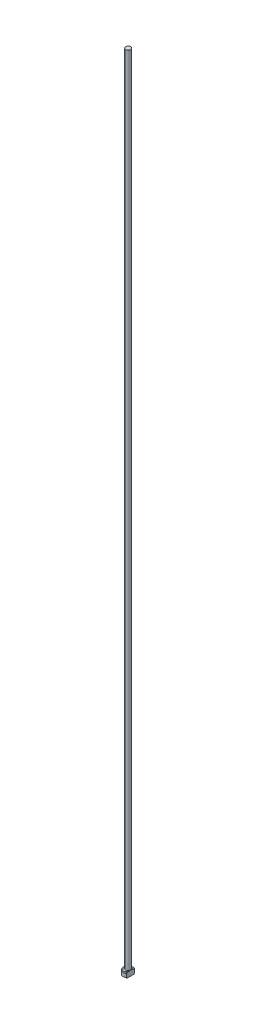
ISO-10303-21;
HEADER;
FILE_DESCRIPTION(('STEP AP214'),'2;1');
FILE_NAME('part.step','',(''),(''),'','','');
FILE_SCHEMA(('AUTOMOTIVE_DESIGN { 1 0 10303 214 1 1 1 1 }'));
ENDSEC;
DATA;
#1=APPLICATION_CONTEXT('core data for automotive mechanical design processes');
#2=APPLICATION_PROTOCOL_DEFINITION('international standard','automotive_design',2000,#1);
#3=PRODUCT_CONTEXT('',#1,'mechanical');
#4=PRODUCT('Part','Part','',(#3));
#5=PRODUCT_RELATED_PRODUCT_CATEGORY('part','',(#4));
#6=PRODUCT_DEFINITION_FORMATION('','',#4);
#7=PRODUCT_DEFINITION_CONTEXT('part definition',#1,'design');
#8=PRODUCT_DEFINITION('design','',#6,#7);
#9=PRODUCT_DEFINITION_SHAPE('','',#8);
#10=(LENGTH_UNIT() NAMED_UNIT(*) SI_UNIT(.MILLI.,.METRE.));
#11=(NAMED_UNIT(*) PLANE_ANGLE_UNIT() SI_UNIT($,.RADIAN.));
#12=(NAMED_UNIT(*) SI_UNIT($,.STERADIAN.) SOLID_ANGLE_UNIT());
#13=UNCERTAINTY_MEASURE_WITH_UNIT(LENGTH_MEASURE(1.E-05),#10,'distance_accuracy_value','');
#14=(GEOMETRIC_REPRESENTATION_CONTEXT(3) GLOBAL_UNCERTAINTY_ASSIGNED_CONTEXT((#13)) GLOBAL_UNIT_ASSIGNED_CONTEXT((#10,
#11,#12)) REPRESENTATION_CONTEXT('',''));
#15=CARTESIAN_POINT('',(0.,0.,0.));
#16=DIRECTION('',(0.,0.,1.));
#17=DIRECTION('',(1.,0.,0.));
#18=AXIS2_PLACEMENT_3D('',#15,#16,#17);
#19=CARTESIAN_POINT('',(0.,0.,0.));
#20=DIRECTION('',(0.,-1.,0.));
#21=DIRECTION('',(0.,0.,-1.));
#22=AXIS2_PLACEMENT_3D('',#19,#20,#21);
#23=PLANE('',#22);
#24=CARTESIAN_POINT('',(0.,0.,0.));
#25=DIRECTION('',(0.,-1.,0.));
#26=DIRECTION('',(0.,0.,-1.));
#27=AXIS2_PLACEMENT_3D('',#24,#25,#26);
#28=CIRCLE('',#27,1.29999999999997);
#29=CARTESIAN_POINT('',(0.799999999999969,0.,1.02469507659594));
#30=VERTEX_POINT('',#29);
#31=CARTESIAN_POINT('',(0.799999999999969,0.,-1.02469507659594));
#32=VERTEX_POINT('',#31);
#33=EDGE_CURVE('E98',#30,#32,#28,.T.);
#34=ORIENTED_EDGE('',*,*,#33,.T.);
#35=DIRECTION('',(0.,0.,1.));
#36=VECTOR('',#35,1.);
#37=CARTESIAN_POINT('',(0.799999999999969,0.,-1.26885775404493));
#38=LINE('',#37,#36);
#39=EDGE_CURVE('E83',#32,#30,#38,.T.);
#40=ORIENTED_EDGE('',*,*,#39,.T.);
#41=EDGE_LOOP('',(#34,#40));
#42=FACE_BOUND('',#41,.T.);
#43=ADVANCED_FACE('F32',(#42),#23,.T.);
#44=CARTESIAN_POINT('',(0.,259.958771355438,0.));
#45=DIRECTION('',(0.,1.,0.));
#46=DIRECTION('',(0.,0.,1.));
#47=AXIS2_PLACEMENT_3D('',#44,#45,#46);
#48=CYLINDRICAL_SURFACE('',#47,1.49999999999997);
#49=CARTESIAN_POINT('',(0.,1.29999999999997,0.));
#50=DIRECTION('',(0.,1.,0.));
#51=DIRECTION('',(0.,0.,1.));
#52=AXIS2_PLACEMENT_3D('',#49,#50,#51);
#53=CIRCLE('',#52,1.49999999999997);
#54=CARTESIAN_POINT('',(0.799999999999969,1.29999999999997,1.26885775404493));
#55=VERTEX_POINT('',#54);
#56=CARTESIAN_POINT('',(0.799999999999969,1.29999999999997,-1.26885775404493));
#57=VERTEX_POINT('',#56);
#58=EDGE_CURVE('E104',#55,#57,#53,.F.);
#59=ORIENTED_EDGE('',*,*,#58,.T.);
#60=DIRECTION('',(0.,-1.,0.));
#61=VECTOR('',#60,1.);
#62=CARTESIAN_POINT('',(0.799999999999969,250.,-1.26885775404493));
#63=LINE('',#62,#61);
#64=CARTESIAN_POINT('',(0.799999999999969,0.199999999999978,-1.26885775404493));
#65=VERTEX_POINT('',#64);
#66=EDGE_CURVE('E183',#57,#65,#63,.T.);
#67=ORIENTED_EDGE('',*,*,#66,.T.);
#68=CARTESIAN_POINT('',(0.,0.199999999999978,0.));
#69=DIRECTION('',(0.,-1.,0.));
#70=DIRECTION('',(0.,0.,-1.));
#71=AXIS2_PLACEMENT_3D('',#68,#69,#70);
#72=CIRCLE('',#71,1.49999999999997);
#73=CARTESIAN_POINT('',(0.799999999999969,0.199999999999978,1.26885775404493));
#74=VERTEX_POINT('',#73);
#75=EDGE_CURVE('E100',#65,#74,#72,.F.);
#76=ORIENTED_EDGE('',*,*,#75,.T.);
#77=DIRECTION('',(0.,-1.,0.));
#78=VECTOR('',#77,1.);
#79=CARTESIAN_POINT('',(0.799999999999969,250.,1.26885775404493));
#80=LINE('',#79,#78);
#81=EDGE_CURVE('E93',#55,#74,#80,.T.);
#82=ORIENTED_EDGE('',*,*,#81,.F.);
#83=EDGE_LOOP('',(#59,#67,#76,#82));
#84=FACE_BOUND('',#83,.T.);
#85=ADVANCED_FACE('F158',(#84),#48,.T.);
#86=CARTESIAN_POINT('',(-1.49999999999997,1.5,0.));
#87=DIRECTION('',(0.,1.,0.));
#88=DIRECTION('',(0.,0.,1.));
#89=AXIS2_PLACEMENT_3D('',#86,#87,#88);
#90=PLANE('',#89);
#91=CARTESIAN_POINT('',(0.,1.5,0.));
#92=DIRECTION('',(0.,1.,0.));
#93=DIRECTION('',(0.,0.,1.));
#94=AXIS2_PLACEMENT_3D('',#91,#92,#93);
#95=CIRCLE('',#94,1.29999999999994);
#96=CARTESIAN_POINT('',(0.799999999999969,1.5,-1.02469507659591));
#97=VERTEX_POINT('',#96);
#98=CARTESIAN_POINT('',(0.799999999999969,1.5,1.02469507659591));
#99=VERTEX_POINT('',#98);
#100=EDGE_CURVE('E178',#97,#99,#95,.T.);
#101=ORIENTED_EDGE('',*,*,#100,.T.);
#102=DIRECTION('',(0.,0.,-1.));
#103=VECTOR('',#102,1.);
#104=CARTESIAN_POINT('',(0.799999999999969,1.5,0.));
#105=LINE('',#104,#103);
#106=CARTESIAN_POINT('',(0.799999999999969,1.49999999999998,0.599999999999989));
#107=VERTEX_POINT('',#106);
#108=EDGE_CURVE('E57',#99,#107,#105,.T.);
#109=ORIENTED_EDGE('',*,*,#108,.T.);
#110=CARTESIAN_POINT('',(0.,1.5,0.));
#111=DIRECTION('',(0.,1.,0.));
#112=DIRECTION('',(0.,0.,1.));
#113=AXIS2_PLACEMENT_3D('',#110,#111,#112);
#114=CIRCLE('',#113,0.999999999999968);
#115=CARTESIAN_POINT('',(0.799999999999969,1.49999999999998,-0.600000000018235));
#116=VERTEX_POINT('',#115);
#117=EDGE_CURVE('E107',#107,#116,#114,.F.);
#118=ORIENTED_EDGE('',*,*,#117,.T.);
#119=EDGE_CURVE('E136',#116,#97,#105,.T.);
#120=ORIENTED_EDGE('',*,*,#119,.T.);
#121=EDGE_LOOP('',(#101,#109,#118,#120));
#122=FACE_BOUND('',#121,.T.);
#123=ADVANCED_FACE('F147',(#122),#90,.T.);
#124=CARTESIAN_POINT('',(0.,1.5,0.));
#125=DIRECTION('',(0.,-1.,0.));
#126=DIRECTION('',(0.,0.,-1.));
#127=AXIS2_PLACEMENT_3D('',#124,#125,#126);
#128=CONICAL_SURFACE('',#127,1.29999999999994,0.785398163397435);
#129=ORIENTED_EDGE('',*,*,#58,.F.);
#130=CARTESIAN_POINT('',(0.799999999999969,-0.108590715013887,2.79640840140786));
#131=CARTESIAN_POINT('',(0.799999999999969,-0.000882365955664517,2.68432462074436));
#132=CARTESIAN_POINT('',(0.799999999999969,0.106624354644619,2.57204275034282));
#133=CARTESIAN_POINT('',(0.799999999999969,0.320918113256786,2.34672914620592));
#134=CARTESIAN_POINT('',(0.799999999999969,0.427704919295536,2.23369719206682));
#135=CARTESIAN_POINT('',(0.799999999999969,0.639300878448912,2.00753337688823));
#136=CARTESIAN_POINT('',(0.799999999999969,0.744119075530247,1.894410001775));
#137=CARTESIAN_POINT('',(0.799999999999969,0.951972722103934,1.66655886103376));
#138=CARTESIAN_POINT('',(0.799999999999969,1.05500843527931,1.55183133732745));
#139=CARTESIAN_POINT('',(0.799999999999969,1.2316116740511,1.34966755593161));
#140=CARTESIAN_POINT('',(0.799999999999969,1.30589617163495,1.26286366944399));
#141=CARTESIAN_POINT('',(0.799999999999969,1.41524859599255,1.13055151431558));
#142=CARTESIAN_POINT('',(0.799999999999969,1.45144464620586,1.08597829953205));
#143=CARTESIAN_POINT('',(0.799999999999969,1.52278909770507,0.99600355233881));
#144=CARTESIAN_POINT('',(0.799999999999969,1.55793758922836,0.950602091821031));
#145=CARTESIAN_POINT('',(0.799999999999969,1.62707562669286,0.858309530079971));
#146=CARTESIAN_POINT('',(0.799999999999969,1.66105269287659,0.81140901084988));
#147=CARTESIAN_POINT('',(0.799999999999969,1.72689099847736,0.716070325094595));
#148=CARTESIAN_POINT('',(0.799999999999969,1.75875040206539,0.667630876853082));
#149=CARTESIAN_POINT('',(0.799999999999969,1.81908230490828,0.568961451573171));
#150=CARTESIAN_POINT('',(0.799999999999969,1.84757011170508,0.518741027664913));
#151=CARTESIAN_POINT('',(0.799999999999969,1.89949059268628,0.415809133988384));
#152=CARTESIAN_POINT('',(0.799999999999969,1.92293317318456,0.363102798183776));
#153=CARTESIAN_POINT('',(0.799999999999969,1.96197481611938,0.254586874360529));
#154=CARTESIAN_POINT('',(0.799999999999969,1.97756580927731,0.19877415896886));
#155=CARTESIAN_POINT('',(0.799999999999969,1.99243400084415,0.113761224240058));
#156=CARTESIAN_POINT('',(0.799999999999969,1.99597240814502,0.0852975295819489));
#157=CARTESIAN_POINT('',(0.799999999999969,2.00001065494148,0.0281499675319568));
#158=CARTESIAN_POINT('',(0.799999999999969,2.00051084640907,-0.000533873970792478));
#159=CARTESIAN_POINT('',(0.799999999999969,1.99842510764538,-0.0578277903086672));
#160=CARTESIAN_POINT('',(0.799999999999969,1.99583465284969,-0.0864376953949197));
#161=CARTESIAN_POINT('',(0.799999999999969,1.98776318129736,-0.143248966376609));
#162=CARTESIAN_POINT('',(0.799999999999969,1.98228105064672,-0.171450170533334));
#163=CARTESIAN_POINT('',(0.799999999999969,1.96874374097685,-0.227447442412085));
#164=CARTESIAN_POINT('',(0.799999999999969,1.96066903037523,-0.255238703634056));
#165=CARTESIAN_POINT('',(0.799999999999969,1.94239006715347,-0.310100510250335));
#166=CARTESIAN_POINT('',(0.799999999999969,1.93218575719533,-0.337171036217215));
#167=CARTESIAN_POINT('',(0.799999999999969,1.89406620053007,-0.429279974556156));
#168=CARTESIAN_POINT('',(0.799999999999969,1.86189848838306,-0.492545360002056));
#169=CARTESIAN_POINT('',(0.799999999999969,1.79172992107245,-0.615769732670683));
#170=CARTESIAN_POINT('',(0.799999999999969,1.75371426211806,-0.675719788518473));
#171=CARTESIAN_POINT('',(0.799999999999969,1.6737943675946,-0.793878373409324));
#172=CARTESIAN_POINT('',(0.799999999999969,1.63185308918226,-0.852061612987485));
#173=CARTESIAN_POINT('',(0.799999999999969,1.54580257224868,-0.966661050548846));
#174=CARTESIAN_POINT('',(0.799999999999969,1.50169617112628,-1.02307941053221));
#175=CARTESIAN_POINT('',(0.799999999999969,1.39425482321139,-1.15684265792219));
#176=CARTESIAN_POINT('',(0.799999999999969,1.33022313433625,-1.23362537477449));
#177=CARTESIAN_POINT('',(0.799999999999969,1.20042261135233,-1.38571338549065));
#178=CARTESIAN_POINT('',(0.799999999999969,1.13465351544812,-1.46101845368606));
#179=CARTESIAN_POINT('',(0.799999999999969,1.00190865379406,-1.61069142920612));
#180=CARTESIAN_POINT('',(0.799999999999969,0.934931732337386,-1.68505830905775));
#181=CARTESIAN_POINT('',(0.799999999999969,0.8001914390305,-1.83307655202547));
#182=CARTESIAN_POINT('',(0.799999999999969,0.732428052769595,-1.90672790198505));
#183=CARTESIAN_POINT('',(0.799999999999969,0.600628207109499,-2.04887725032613));
#184=CARTESIAN_POINT('',(0.799999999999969,0.536626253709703,-2.11740728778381));
#185=CARTESIAN_POINT('',(0.799999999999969,0.408245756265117,-2.25411608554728));
#186=CARTESIAN_POINT('',(0.799999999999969,0.343867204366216,-2.32229483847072));
#187=CARTESIAN_POINT('',(0.799999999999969,0.214937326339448,-2.45825447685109));
#188=CARTESIAN_POINT('',(0.799999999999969,0.150386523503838,-2.52603585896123));
#189=CARTESIAN_POINT('',(0.799999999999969,0.0210558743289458,-2.66137559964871));
#190=CARTESIAN_POINT('',(0.799999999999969,-0.0437239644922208,-2.72893396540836));
#191=CARTESIAN_POINT('',(0.799999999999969,-0.108590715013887,-2.79640840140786));
#192=B_SPLINE_CURVE_WITH_KNOTS('',3,(#130,#131,#132,#133,#134,#135,#136,#137,#138,#139,#140,
#141,#142,#143,#144,#145,#146,#147,#148,#149,#150,#151,#152,#153,#154,#155,#156,#157,#158,#159,
#160,#161,#162,#163,#164,#165,#166,#167,#168,#169,#170,#171,#172,#173,#174,#175,#176,#177,#178,
#179,#180,#181,#182,#183,#184,#185,#186,#187,#188,#189,#190,#191),.UNSPECIFIED.,.F.,.F.,(4,2,2,
2,2,2,2,2,2,2,2,2,2,2,2,2,2,2,2,2,2,2,2,2,2,2,2,2,2,2,4),(0.,0.466346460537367,
0.932836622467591,1.39548573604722,1.85806581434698,2.20076900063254,2.37301446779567,
2.54524505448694,2.71894834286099,2.89280030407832,3.06582993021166,3.23851664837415,
3.41138048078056,3.49728508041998,3.58317972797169,3.66920027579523,3.75525398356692,
3.84197183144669,3.92869201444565,4.14096510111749,4.35378466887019,4.56886671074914,
4.78367404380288,5.08356111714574,5.38349363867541,5.68373022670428,5.9839723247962,
6.26527738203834,6.54658832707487,6.82739033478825,7.10818320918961),.UNSPECIFIED.);
#193=EDGE_CURVE('E135',#55,#99,#192,.T.);
#194=ORIENTED_EDGE('',*,*,#193,.T.);
#195=ORIENTED_EDGE('',*,*,#100,.F.);
#196=EDGE_CURVE('E127',#97,#57,#192,.T.);
#197=ORIENTED_EDGE('',*,*,#196,.T.);
#198=EDGE_LOOP('',(#129,#194,#195,#197));
#199=FACE_BOUND('',#198,.T.);
#200=ADVANCED_FACE('F143',(#199),#128,.T.);
#201=CARTESIAN_POINT('',(0.,0.199999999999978,0.));
#202=DIRECTION('',(0.,1.,0.));
#203=DIRECTION('',(0.,0.,1.));
#204=AXIS2_PLACEMENT_3D('',#201,#202,#203);
#205=CONICAL_SURFACE('',#204,1.49999999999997,0.785398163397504);
#206=ORIENTED_EDGE('',*,*,#75,.F.);
#207=CARTESIAN_POINT('',(0.799999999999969,1.60859071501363,-2.79640840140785));
#208=CARTESIAN_POINT('',(0.799999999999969,1.50088236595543,-2.68432462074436));
#209=CARTESIAN_POINT('',(0.799999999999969,1.39337564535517,-2.57204275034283));
#210=CARTESIAN_POINT('',(0.799999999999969,1.17908188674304,-2.34672914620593));
#211=CARTESIAN_POINT('',(0.799999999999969,1.07229508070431,-2.23369719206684));
#212=CARTESIAN_POINT('',(0.799999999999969,0.860699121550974,-2.00753337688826));
#213=CARTESIAN_POINT('',(0.799999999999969,0.75588092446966,-1.89441000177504));
#214=CARTESIAN_POINT('',(0.799999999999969,0.548027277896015,-1.66655886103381));
#215=CARTESIAN_POINT('',(0.799999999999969,0.444991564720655,-1.55183133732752));
#216=CARTESIAN_POINT('',(0.799999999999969,0.268388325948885,-1.34966755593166));
#217=CARTESIAN_POINT('',(0.799999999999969,0.194103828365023,-1.26286366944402));
#218=CARTESIAN_POINT('',(0.799999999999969,0.0847514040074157,-1.13055151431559));
#219=CARTESIAN_POINT('',(0.799999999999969,0.0485553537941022,-1.08597829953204));
#220=CARTESIAN_POINT('',(0.799999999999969,-0.02278909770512,-0.996003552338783));
#221=CARTESIAN_POINT('',(0.799999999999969,-0.0579375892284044,-0.950602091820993));
#222=CARTESIAN_POINT('',(0.799999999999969,-0.127075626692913,-0.85830953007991));
#223=CARTESIAN_POINT('',(0.799999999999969,-0.161052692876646,-0.811409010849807));
#224=CARTESIAN_POINT('',(0.799999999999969,-0.226890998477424,-0.716070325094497));
#225=CARTESIAN_POINT('',(0.799999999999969,-0.258750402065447,-0.667630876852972));
#226=CARTESIAN_POINT('',(0.799999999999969,-0.319082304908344,-0.568961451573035));
#227=CARTESIAN_POINT('',(0.799999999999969,-0.347570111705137,-0.518741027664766));
#228=CARTESIAN_POINT('',(0.799999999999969,-0.399490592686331,-0.41580913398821));
#229=CARTESIAN_POINT('',(0.799999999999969,-0.422933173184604,-0.363102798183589));
#230=CARTESIAN_POINT('',(0.799999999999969,-0.461974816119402,-0.254586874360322));
#231=CARTESIAN_POINT('',(0.799999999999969,-0.477565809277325,-0.198774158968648));
#232=CARTESIAN_POINT('',(0.799999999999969,-0.492434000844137,-0.113761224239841));
#233=CARTESIAN_POINT('',(0.799999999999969,-0.495972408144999,-0.0852975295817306));
#234=CARTESIAN_POINT('',(0.799999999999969,-0.500010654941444,-0.0281499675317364));
#235=CARTESIAN_POINT('',(0.799999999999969,-0.500510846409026,0.000533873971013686));
#236=CARTESIAN_POINT('',(0.799999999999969,-0.49842510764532,0.0578277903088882));
#237=CARTESIAN_POINT('',(0.799999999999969,-0.495834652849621,0.0864376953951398));
#238=CARTESIAN_POINT('',(0.799999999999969,-0.487763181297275,0.143248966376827));
#239=CARTESIAN_POINT('',(0.799999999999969,-0.482281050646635,0.17145017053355));
#240=CARTESIAN_POINT('',(0.799999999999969,-0.468743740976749,0.227447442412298));
#241=CARTESIAN_POINT('',(0.799999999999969,-0.460669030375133,0.255238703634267));
#242=CARTESIAN_POINT('',(0.799999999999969,-0.442390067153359,0.310100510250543));
#243=CARTESIAN_POINT('',(0.799999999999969,-0.432185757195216,0.33717103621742));
#244=CARTESIAN_POINT('',(0.799999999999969,-0.394066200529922,0.429279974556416));
#245=CARTESIAN_POINT('',(0.799999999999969,-0.361898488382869,0.492545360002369));
#246=CARTESIAN_POINT('',(0.799999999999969,-0.291729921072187,0.615769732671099));
#247=CARTESIAN_POINT('',(0.799999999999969,-0.253714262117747,0.675719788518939));
#248=CARTESIAN_POINT('',(0.799999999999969,-0.173794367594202,0.793878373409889));
#249=CARTESIAN_POINT('',(0.799999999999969,-0.131853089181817,0.852061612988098));
#250=CARTESIAN_POINT('',(0.799999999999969,-0.0458025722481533,0.966661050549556));
#251=CARTESIAN_POINT('',(0.799999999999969,-0.00169617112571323,1.02307941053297));
#252=CARTESIAN_POINT('',(0.799999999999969,0.10574517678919,1.15684265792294));
#253=CARTESIAN_POINT('',(0.799999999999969,0.169776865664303,1.2336253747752));
#254=CARTESIAN_POINT('',(0.799999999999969,0.299577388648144,1.38571338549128));
#255=CARTESIAN_POINT('',(0.799999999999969,0.365346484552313,1.46101845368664));
#256=CARTESIAN_POINT('',(0.799999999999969,0.498091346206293,1.61069142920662));
#257=CARTESIAN_POINT('',(0.799999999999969,0.565068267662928,1.68505830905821));
#258=CARTESIAN_POINT('',(0.799999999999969,0.699808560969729,1.83307655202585));
#259=CARTESIAN_POINT('',(0.799999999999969,0.767571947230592,1.9067279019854));
#260=CARTESIAN_POINT('',(0.799999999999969,0.899371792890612,2.04887725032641));
#261=CARTESIAN_POINT('',(0.799999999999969,0.963373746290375,2.11740728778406));
#262=CARTESIAN_POINT('',(0.799999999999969,1.09175424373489,2.25411608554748));
#263=CARTESIAN_POINT('',(0.799999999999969,1.15613279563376,2.32229483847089));
#264=CARTESIAN_POINT('',(0.799999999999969,1.28506267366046,2.45825447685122));
#265=CARTESIAN_POINT('',(0.799999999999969,1.34961347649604,2.52603585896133));
#266=CARTESIAN_POINT('',(0.799999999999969,1.47894412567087,2.66137559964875));
#267=CARTESIAN_POINT('',(0.799999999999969,1.543723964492,2.72893396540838));
#268=CARTESIAN_POINT('',(0.799999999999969,1.60859071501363,2.79640840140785));
#269=B_SPLINE_CURVE_WITH_KNOTS('',3,(#207,#208,#209,#210,#211,#212,#213,#214,#215,#216,#217,
#218,#219,#220,#221,#222,#223,#224,#225,#226,#227,#228,#229,#230,#231,#232,#233,#234,#235,#236,
#237,#238,#239,#240,#241,#242,#243,#244,#245,#246,#247,#248,#249,#250,#251,#252,#253,#254,#255,
#256,#257,#258,#259,#260,#261,#262,#263,#264,#265,#266,#267,#268),.UNSPECIFIED.,.F.,.F.,(4,2,2,
2,2,2,2,2,2,2,2,2,2,2,2,2,2,2,2,2,2,2,2,2,2,2,2,2,2,2,4),(0.,0.466346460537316,0.93283662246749,
1.39548573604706,1.85806581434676,2.20076900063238,2.37301446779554,2.54524505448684,
2.71894834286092,2.89280030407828,3.06582993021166,3.23851664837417,3.41138048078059,
3.49728508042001,3.58317972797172,3.66920027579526,3.75525398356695,3.84197183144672,
3.92869201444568,4.14096510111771,4.3537846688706,4.56886671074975,4.78367404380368,
5.08356111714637,5.38349363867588,5.68373022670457,5.98397232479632,6.26527738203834,
6.54658832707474,6.82739033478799,7.10818320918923),.UNSPECIFIED.);
#270=EDGE_CURVE('E86',#65,#32,#269,.T.);
#271=ORIENTED_EDGE('',*,*,#270,.T.);
#272=ORIENTED_EDGE('',*,*,#33,.F.);
#273=EDGE_CURVE('E89',#30,#74,#269,.T.);
#274=ORIENTED_EDGE('',*,*,#273,.T.);
#275=EDGE_LOOP('',(#206,#271,#272,#274));
#276=FACE_BOUND('',#275,.T.);
#277=ADVANCED_FACE('F97',(#276),#205,.T.);
#278=CARTESIAN_POINT('',(0.,1.69999999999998,0.));
#279=DIRECTION('',(0.,1.,0.));
#280=DIRECTION('',(0.,0.,1.));
#281=AXIS2_PLACEMENT_3D('',#278,#279,#280);
#282=TOROIDAL_SURFACE('',#281,0.999999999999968,0.2);
#283=CARTESIAN_POINT('',(0.799999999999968,1.69999999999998,0.));
#284=CARTESIAN_POINT('',(0.799999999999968,1.70000052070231,-1.07740569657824E-10));
#285=CARTESIAN_POINT('',(0.799999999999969,1.70000104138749,-8.25850860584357E-08));
#286=CARTESIAN_POINT('',(0.799999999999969,1.7000020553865,-3.57496578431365E-07));
#287=CARTESIAN_POINT('',(0.799999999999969,1.7000025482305,-5.51414205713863E-07));
#288=CARTESIAN_POINT('',(0.799999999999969,1.70000352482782,-1.02256682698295E-06));
#289=CARTESIAN_POINT('',(0.799999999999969,1.70000400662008,-1.30376835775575E-06));
#290=CARTESIAN_POINT('',(0.799999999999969,1.7000049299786,-1.92036681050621E-06));
#291=CARTESIAN_POINT('',(0.799999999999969,1.70000537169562,-2.25554622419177E-06));
#292=CARTESIAN_POINT('',(0.799999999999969,1.70000679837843,-3.42582461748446E-06));
#293=CARTESIAN_POINT('',(0.799999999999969,1.7000077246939,-4.33303061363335E-06));
#294=CARTESIAN_POINT('',(0.799999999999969,1.70000942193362,-6.24182407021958E-06));
#295=CARTESIAN_POINT('',(0.799999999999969,1.70001019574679,-7.24099037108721E-06));
#296=CARTESIAN_POINT('',(0.799999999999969,1.70001296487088,-1.10006264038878E-05));
#297=CARTESIAN_POINT('',(0.799999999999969,1.70001480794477,-1.38764659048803E-05));
#298=CARTESIAN_POINT('',(0.799999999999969,1.70001794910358,-1.96579256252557E-05));
#299=CARTESIAN_POINT('',(0.799999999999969,1.70001927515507,-2.25490182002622E-05));
#300=CARTESIAN_POINT('',(0.799999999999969,1.70002465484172,-3.44465536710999E-05));
#301=CARTESIAN_POINT('',(0.799999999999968,1.70002857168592,-4.35098174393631E-05));
#302=CARTESIAN_POINT('',(0.799999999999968,1.70003510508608,-6.07223717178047E-05));
#303=CARTESIAN_POINT('',(0.799999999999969,1.70003782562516,-6.88309361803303E-05));
#304=CARTESIAN_POINT('',(0.799999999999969,1.70005864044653,-0.000125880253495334));
#305=CARTESIAN_POINT('',(0.799999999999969,1.70008424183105,-0.000171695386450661));
#306=CARTESIAN_POINT('',(0.799999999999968,1.70017855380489,-0.00034720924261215));
#307=CARTESIAN_POINT('',(0.799999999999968,1.70024169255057,-0.000479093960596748));
#308=CARTESIAN_POINT('',(0.799999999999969,1.70048616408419,-0.000981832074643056));
#309=CARTESIAN_POINT('',(0.799999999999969,1.70067331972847,-0.00135043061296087));
#310=CARTESIAN_POINT('',(0.799999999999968,1.70142117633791,-0.00283094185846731));
#311=CARTESIAN_POINT('',(0.799999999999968,1.70197535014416,-0.00394535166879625));
#312=CARTESIAN_POINT('',(0.799999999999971,1.71061058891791,-0.0213011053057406));
#313=CARTESIAN_POINT('',(0.799999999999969,1.71874400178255,-0.0375230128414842));
#314=CARTESIAN_POINT('',(0.799999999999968,1.73460832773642,-0.0694811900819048));
#315=CARTESIAN_POINT('',(0.799999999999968,1.74234357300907,-0.0852154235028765));
#316=CARTESIAN_POINT('',(0.799999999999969,1.75846316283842,-0.118454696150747));
#317=CARTESIAN_POINT('',(0.799999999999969,1.7668284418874,-0.135969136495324));
#318=CARTESIAN_POINT('',(0.799999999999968,1.78329738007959,-0.171319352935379));
#319=CARTESIAN_POINT('',(0.799999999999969,1.79139788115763,-0.189156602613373));
#320=CARTESIAN_POINT('',(0.799999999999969,1.81123303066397,-0.234404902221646));
#321=CARTESIAN_POINT('',(0.799999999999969,1.82265785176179,-0.261953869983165));
#322=CARTESIAN_POINT('',(0.799999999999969,1.84367616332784,-0.31710366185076));
#323=CARTESIAN_POINT('',(0.799999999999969,1.85330270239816,-0.344691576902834));
#324=CARTESIAN_POINT('',(0.799999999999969,1.86619221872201,-0.38675392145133));
#325=CARTESIAN_POINT('',(0.799999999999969,1.87025173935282,-0.400983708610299));
#326=CARTESIAN_POINT('',(0.799999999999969,1.87774404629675,-0.429670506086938));
#327=CARTESIAN_POINT('',(0.799999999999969,1.8811740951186,-0.44412822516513));
#328=CARTESIAN_POINT('',(0.799999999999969,1.89063941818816,-0.489163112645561));
#329=CARTESIAN_POINT('',(0.799999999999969,1.89540671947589,-0.520030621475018));
#330=CARTESIAN_POINT('',(0.799999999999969,1.90049267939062,-0.58212622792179));
#331=CARTESIAN_POINT('',(0.799999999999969,1.90081735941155,-0.613353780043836));
#332=CARTESIAN_POINT('',(0.799999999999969,1.89549709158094,-0.674915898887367));
#333=CARTESIAN_POINT('',(0.799999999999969,1.88995916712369,-0.705256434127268));
#334=CARTESIAN_POINT('',(0.799999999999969,1.8763682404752,-0.747474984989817));
#335=CARTESIAN_POINT('',(0.799999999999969,1.8713676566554,-0.760339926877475));
#336=CARTESIAN_POINT('',(0.799999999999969,1.85959942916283,-0.785299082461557));
#337=CARTESIAN_POINT('',(0.799999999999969,1.85282697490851,-0.79739108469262));
#338=CARTESIAN_POINT('',(0.799999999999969,1.83727733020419,-0.820446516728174));
#339=CARTESIAN_POINT('',(0.799999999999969,1.82847700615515,-0.831394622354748));
#340=CARTESIAN_POINT('',(0.799999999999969,1.80887943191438,-0.851318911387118));
#341=CARTESIAN_POINT('',(0.799999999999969,1.79808937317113,-0.860301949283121));
#342=CARTESIAN_POINT('',(0.799999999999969,1.77879935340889,-0.872872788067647));
#343=CARTESIAN_POINT('',(0.799999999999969,1.77081074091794,-0.877249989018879));
#344=CARTESIAN_POINT('',(0.799999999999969,1.75421627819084,-0.884624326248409));
#345=CARTESIAN_POINT('',(0.799999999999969,1.74561080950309,-0.887622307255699));
#346=CARTESIAN_POINT('',(0.799999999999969,1.72796171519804,-0.892065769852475));
#347=CARTESIAN_POINT('',(0.799999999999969,1.7189162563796,-0.893504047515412));
#348=CARTESIAN_POINT('',(0.799999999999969,1.70071433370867,-0.894703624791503));
#349=CARTESIAN_POINT('',(0.799999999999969,1.69155789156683,-0.894465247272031));
#350=CARTESIAN_POINT('',(0.799999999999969,1.67411305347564,-0.892409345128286));
#351=CARTESIAN_POINT('',(0.799999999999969,1.66581040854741,-0.890709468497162));
#352=CARTESIAN_POINT('',(0.799999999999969,1.64959326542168,-0.885987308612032));
#353=CARTESIAN_POINT('',(0.799999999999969,1.64167879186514,-0.882964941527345));
#354=CARTESIAN_POINT('',(0.799999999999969,1.62612521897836,-0.875619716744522));
#355=CARTESIAN_POINT('',(0.799999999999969,1.6185069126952,-0.871253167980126));
#356=CARTESIAN_POINT('',(0.799999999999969,1.60398538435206,-0.861466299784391));
#357=CARTESIAN_POINT('',(0.799999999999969,1.59708247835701,-0.856045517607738));
#358=CARTESIAN_POINT('',(0.799999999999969,1.58115991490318,-0.841751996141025));
#359=CARTESIAN_POINT('',(0.799999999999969,1.57255696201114,-0.832413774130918));
#360=CARTESIAN_POINT('',(0.799999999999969,1.5569709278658,-0.812463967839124));
#361=CARTESIAN_POINT('',(0.799999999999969,1.54999208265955,-0.80184916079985));
#362=CARTESIAN_POINT('',(0.799999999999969,1.53507995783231,-0.775315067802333));
#363=CARTESIAN_POINT('',(0.799999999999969,1.52789105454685,-0.758978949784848));
#364=CARTESIAN_POINT('',(0.799999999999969,1.51619194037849,-0.72544267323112));
#365=CARTESIAN_POINT('',(0.799999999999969,1.51167841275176,-0.708243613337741));
#366=CARTESIAN_POINT('',(0.799999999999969,1.50308125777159,-0.664008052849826));
#367=CARTESIAN_POINT('',(0.799999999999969,1.50054575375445,-0.636674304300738));
#368=CARTESIAN_POINT('',(0.799999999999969,1.49960545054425,-0.581571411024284));
#369=CARTESIAN_POINT('',(0.799999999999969,1.50126887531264,-0.553802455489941));
#370=CARTESIAN_POINT('',(0.799999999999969,1.51076969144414,-0.474087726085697));
#371=CARTESIAN_POINT('',(0.799999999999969,1.52278886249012,-0.422656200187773));
#372=CARTESIAN_POINT('',(0.799999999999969,1.54542054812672,-0.348884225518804));
#373=CARTESIAN_POINT('',(0.799999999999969,1.553391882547,-0.325596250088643));
#374=CARTESIAN_POINT('',(0.799999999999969,1.57044260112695,-0.279605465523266));
#375=CARTESIAN_POINT('',(0.799999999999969,1.5795136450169,-0.256899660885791));
#376=CARTESIAN_POINT('',(0.799999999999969,1.59612615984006,-0.217481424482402));
#377=CARTESIAN_POINT('',(0.799999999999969,1.60348346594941,-0.200689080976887));
#378=CARTESIAN_POINT('',(0.799999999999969,1.61873273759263,-0.16689025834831));
#379=CARTESIAN_POINT('',(0.799999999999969,1.62663303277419,-0.1498875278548));
#380=CARTESIAN_POINT('',(0.799999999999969,1.64000428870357,-0.12169659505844));
#381=CARTESIAN_POINT('',(0.799999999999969,1.64540046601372,-0.110472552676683));
#382=CARTESIAN_POINT('',(0.799999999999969,1.65623294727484,-0.088168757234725));
#383=CARTESIAN_POINT('',(0.799999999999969,1.66166844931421,-0.0770886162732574));
#384=CARTESIAN_POINT('',(0.799999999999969,1.67206713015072,-0.0560154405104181));
#385=CARTESIAN_POINT('',(0.799999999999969,1.67702562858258,-0.0460200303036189));
#386=CARTESIAN_POINT('',(0.799999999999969,1.68715625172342,-0.0257066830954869));
#387=CARTESIAN_POINT('',(0.799999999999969,1.69232987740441,-0.0153894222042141));
#388=CARTESIAN_POINT('',(0.799999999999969,1.69802413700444,-0.00394656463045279));
#389=CARTESIAN_POINT('',(0.799999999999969,1.69857766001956,-0.00283331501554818));
#390=CARTESIAN_POINT('',(0.799999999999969,1.69932534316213,-0.00135310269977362));
#391=CARTESIAN_POINT('',(0.799999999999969,1.69951294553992,-0.000983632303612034));
#392=CARTESIAN_POINT('',(0.799999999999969,1.69975796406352,-0.000479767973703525));
#393=CARTESIAN_POINT('',(0.799999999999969,1.69982122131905,-0.000347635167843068));
#394=CARTESIAN_POINT('',(0.799999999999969,1.69991569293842,-0.000171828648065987));
#395=CARTESIAN_POINT('',(0.799999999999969,1.69994132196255,-0.000125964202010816));
#396=CARTESIAN_POINT('',(0.799999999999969,1.69996215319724,-6.88565605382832E-05));
#397=CARTESIAN_POINT('',(0.799999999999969,1.69996487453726,-6.07436450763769E-05));
#398=CARTESIAN_POINT('',(0.799999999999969,1.69997141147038,-4.35218238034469E-05));
#399=CARTESIAN_POINT('',(0.799999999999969,1.69997533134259,-3.44537566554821E-05));
#400=CARTESIAN_POINT('',(0.799999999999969,1.69998071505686,-2.25508109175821E-05));
#401=CARTESIAN_POINT('',(0.799999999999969,1.69998204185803,-1.96589688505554E-05));
#402=CARTESIAN_POINT('',(0.799999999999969,1.69998518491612,-1.38761465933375E-05));
#403=CARTESIAN_POINT('',(0.799999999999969,1.69998702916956,-1.09997147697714E-05));
#404=CARTESIAN_POINT('',(0.799999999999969,1.6999897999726,-7.23954686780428E-06));
#405=CARTESIAN_POINT('',(0.799999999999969,1.6999905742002,-6.24031831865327E-06));
#406=CARTESIAN_POINT('',(0.799999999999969,1.69999227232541,-4.33148565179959E-06));
#407=CARTESIAN_POINT('',(0.799999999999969,1.69999319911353,-3.4243052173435E-06));
#408=CARTESIAN_POINT('',(0.799999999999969,1.69999462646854,-2.25416419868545E-06));
#409=CARTESIAN_POINT('',(0.799999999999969,1.69999506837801,-1.9190446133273E-06));
#410=CARTESIAN_POINT('',(0.799999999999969,1.69999599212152,-1.30259970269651E-06));
#411=CARTESIAN_POINT('',(0.799999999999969,1.69999647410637,-1.02149208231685E-06));
#412=CARTESIAN_POINT('',(0.799999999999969,1.69999745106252,-5.50567949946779E-07));
#413=CARTESIAN_POINT('',(0.799999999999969,1.69999794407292,-3.56781844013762E-07));
#414=CARTESIAN_POINT('',(0.799999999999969,1.69999895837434,-8.21863285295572E-08));
#415=CARTESIAN_POINT('',(0.799999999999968,1.69999947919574,1.07761657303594E-10));
#416=CARTESIAN_POINT('',(0.799999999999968,1.69999999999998,0.));
#417=B_SPLINE_CURVE_WITH_KNOTS('',3,(#283,#284,#285,#286,#287,#288,#289,#290,#291,#292,#293,
#294,#295,#296,#297,#298,#299,#300,#301,#302,#303,#304,#305,#306,#307,#308,#309,#310,#311,#312,
#313,#314,#315,#316,#317,#318,#319,#320,#321,#322,#323,#324,#325,#326,#327,#328,#329,#330,#331,
#332,#333,#334,#335,#336,#337,#338,#339,#340,#341,#342,#343,#344,#345,#346,#347,#348,#349,#350,
#351,#352,#353,#354,#355,#356,#357,#358,#359,#360,#361,#362,#363,#364,#365,#366,#367,#368,#369,
#370,#371,#372,#373,#374,#375,#376,#377,#378,#379,#380,#381,#382,#383,#384,#385,#386,#387,#388,
#389,#390,#391,#392,#393,#394,#395,#396,#397,#398,#399,#400,#401,#402,#403,#404,#405,#406,#407,
#408,#409,#410,#411,#412,#413,#414,#415,#416),.UNSPECIFIED.,.T.,.F.,(4,2,2,2,2,2,2,2,2,2,2,2,2,
2,2,2,2,2,2,2,2,2,2,2,2,2,2,2,2,2,2,2,2,2,2,2,2,2,2,2,2,2,2,2,2,2,2,2,2,2,2,2,2,2,2,2,2,2,2,2,2,
2,2,2,2,2,4),(0.,1.56041509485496E-06,3.14209997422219E-06,4.81003054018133E-06,
6.4714008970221E-06,1.03419149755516E-05,1.41300090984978E-05,2.43375473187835E-05,
3.38705168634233E-05,6.34790223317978E-05,8.91110433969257E-05,0.0002457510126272,
0.000685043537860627,0.00192443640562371,0.00565901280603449,0.0600913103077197,
0.112691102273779,0.170916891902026,0.229684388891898,0.319123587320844,0.406709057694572,
0.451087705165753,0.495654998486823,0.589095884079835,0.682410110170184,0.774049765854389,
0.815352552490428,0.856768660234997,0.898682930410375,0.940448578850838,0.967667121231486,
0.994868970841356,1.02219593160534,1.04951763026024,1.07482622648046,1.10013642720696,
1.12637630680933,1.15262773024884,1.19050680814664,1.22848360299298,1.28172910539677,
1.33490845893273,1.41680298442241,1.50003666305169,1.65746622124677,1.73131208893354,
1.80462934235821,1.85962660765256,1.91586794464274,1.95322923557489,1.990253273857,
2.02372755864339,2.05834809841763,2.06207870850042,2.06332103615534,2.06376115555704,
2.06391796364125,2.06394360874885,2.06397323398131,2.06398276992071,2.06399298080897,
2.06399676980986,2.06400064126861,2.06400230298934,2.06400397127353,2.0640055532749,
2.06400711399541),.UNSPECIFIED.);
#418=CARTESIAN_POINT('',(0.799999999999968,1.69999999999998,0.));
#419=VERTEX_POINT('',#418);
#420=EDGE_CURVE('E11',#116,#419,#417,.T.);
#421=ORIENTED_EDGE('',*,*,#420,.F.);
#422=ORIENTED_EDGE('',*,*,#117,.F.);
#423=CARTESIAN_POINT('',(0.799999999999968,1.69999999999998,0.));
#424=CARTESIAN_POINT('',(0.799999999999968,1.69999947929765,1.07740575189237E-10));
#425=CARTESIAN_POINT('',(0.799999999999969,1.69999895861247,8.25850860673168E-08));
#426=CARTESIAN_POINT('',(0.799999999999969,1.69999794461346,3.5749657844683E-07));
#427=CARTESIAN_POINT('',(0.799999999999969,1.69999745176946,5.51414205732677E-07));
#428=CARTESIAN_POINT('',(0.799999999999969,1.69999647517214,1.02256682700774E-06));
#429=CARTESIAN_POINT('',(0.799999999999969,1.69999599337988,1.30376835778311E-06));
#430=CARTESIAN_POINT('',(0.799999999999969,1.69999507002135,1.9203668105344E-06));
#431=CARTESIAN_POINT('',(0.799999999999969,1.69999462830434,2.25554622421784E-06));
#432=CARTESIAN_POINT('',(0.799999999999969,1.69999320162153,3.42582461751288E-06));
#433=CARTESIAN_POINT('',(0.799999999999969,1.69999227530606,4.33303061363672E-06));
#434=CARTESIAN_POINT('',(0.799999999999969,1.69999057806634,6.2418240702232E-06));
#435=CARTESIAN_POINT('',(0.799999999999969,1.69998980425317,7.24099037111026E-06));
#436=CARTESIAN_POINT('',(0.799999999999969,1.69998703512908,1.10006264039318E-05));
#437=CARTESIAN_POINT('',(0.799999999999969,1.69998519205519,1.38764659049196E-05));
#438=CARTESIAN_POINT('',(0.799999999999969,1.69998205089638,1.96579256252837E-05));
#439=CARTESIAN_POINT('',(0.799999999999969,1.69998072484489,2.25490182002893E-05));
#440=CARTESIAN_POINT('',(0.799999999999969,1.69997534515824,3.44465536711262E-05));
#441=CARTESIAN_POINT('',(0.799999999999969,1.69997142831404,4.35098174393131E-05));
#442=CARTESIAN_POINT('',(0.799999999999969,1.69996489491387,6.07223717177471E-05));
#443=CARTESIAN_POINT('',(0.799999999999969,1.6999621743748,6.88309361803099E-05));
#444=CARTESIAN_POINT('',(0.799999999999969,1.69994135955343,0.000125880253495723));
#445=CARTESIAN_POINT('',(0.799999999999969,1.69991575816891,0.000171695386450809));
#446=CARTESIAN_POINT('',(0.799999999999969,1.69982144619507,0.00034720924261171));
#447=CARTESIAN_POINT('',(0.799999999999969,1.69975830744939,0.000479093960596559));
#448=CARTESIAN_POINT('',(0.799999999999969,1.69951383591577,0.000981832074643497));
#449=CARTESIAN_POINT('',(0.799999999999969,1.69932668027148,0.00135043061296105));
#450=CARTESIAN_POINT('',(0.799999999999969,1.69857882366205,0.00283094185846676));
#451=CARTESIAN_POINT('',(0.799999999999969,1.6980246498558,0.00394535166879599));
#452=CARTESIAN_POINT('',(0.799999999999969,1.68938941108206,0.0213011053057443));
#453=CARTESIAN_POINT('',(0.799999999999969,1.68125599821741,0.0375230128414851));
#454=CARTESIAN_POINT('',(0.799999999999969,1.66539167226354,0.0694811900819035));
#455=CARTESIAN_POINT('',(0.799999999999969,1.65765642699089,0.0852154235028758));
#456=CARTESIAN_POINT('',(0.799999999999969,1.64153683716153,0.118454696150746));
#457=CARTESIAN_POINT('',(0.799999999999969,1.63317155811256,0.135969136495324));
#458=CARTESIAN_POINT('',(0.799999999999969,1.61670261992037,0.171319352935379));
#459=CARTESIAN_POINT('',(0.799999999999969,1.60860211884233,0.189156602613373));
#460=CARTESIAN_POINT('',(0.799999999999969,1.58876696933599,0.234404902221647));
#461=CARTESIAN_POINT('',(0.799999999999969,1.57734214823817,0.261953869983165));
#462=CARTESIAN_POINT('',(0.799999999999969,1.55632383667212,0.31710366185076));
#463=CARTESIAN_POINT('',(0.799999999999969,1.5466972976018,0.344691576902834));
#464=CARTESIAN_POINT('',(0.799999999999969,1.53380778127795,0.38675392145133));
#465=CARTESIAN_POINT('',(0.799999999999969,1.52974826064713,0.400983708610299));
#466=CARTESIAN_POINT('',(0.799999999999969,1.52225595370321,0.429670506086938));
#467=CARTESIAN_POINT('',(0.799999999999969,1.51882590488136,0.44412822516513));
#468=CARTESIAN_POINT('',(0.799999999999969,1.5093605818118,0.489163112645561));
#469=CARTESIAN_POINT('',(0.799999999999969,1.50459328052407,0.520030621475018));
#470=CARTESIAN_POINT('',(0.799999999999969,1.49950732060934,0.58212622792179));
#471=CARTESIAN_POINT('',(0.799999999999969,1.49918264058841,0.613353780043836));
#472=CARTESIAN_POINT('',(0.799999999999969,1.50450290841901,0.674915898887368));
#473=CARTESIAN_POINT('',(0.799999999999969,1.51004083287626,0.705256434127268));
#474=CARTESIAN_POINT('',(0.799999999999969,1.52363175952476,0.747474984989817));
#475=CARTESIAN_POINT('',(0.799999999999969,1.52863234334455,0.760339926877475));
#476=CARTESIAN_POINT('',(0.799999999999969,1.54040057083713,0.785299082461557));
#477=CARTESIAN_POINT('',(0.799999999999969,1.54717302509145,0.79739108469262));
#478=CARTESIAN_POINT('',(0.799999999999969,1.56272266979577,0.820446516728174));
#479=CARTESIAN_POINT('',(0.799999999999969,1.57152299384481,0.831394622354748));
#480=CARTESIAN_POINT('',(0.799999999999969,1.59112056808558,0.851318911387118));
#481=CARTESIAN_POINT('',(0.799999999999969,1.60191062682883,0.860301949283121));
#482=CARTESIAN_POINT('',(0.799999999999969,1.62120064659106,0.872872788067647));
#483=CARTESIAN_POINT('',(0.799999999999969,1.62918925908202,0.877249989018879));
#484=CARTESIAN_POINT('',(0.799999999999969,1.64578372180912,0.884624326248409));
#485=CARTESIAN_POINT('',(0.799999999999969,1.65438919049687,0.887622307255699));
#486=CARTESIAN_POINT('',(0.799999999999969,1.67203828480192,0.892065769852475));
#487=CARTESIAN_POINT('',(0.799999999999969,1.68108374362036,0.893504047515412));
#488=CARTESIAN_POINT('',(0.799999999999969,1.69928566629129,0.894703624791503));
#489=CARTESIAN_POINT('',(0.799999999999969,1.70844210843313,0.894465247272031));
#490=CARTESIAN_POINT('',(0.799999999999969,1.72588694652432,0.892409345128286));
#491=CARTESIAN_POINT('',(0.799999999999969,1.73418959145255,0.890709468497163));
#492=CARTESIAN_POINT('',(0.799999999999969,1.75040673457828,0.885987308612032));
#493=CARTESIAN_POINT('',(0.799999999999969,1.75832120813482,0.882964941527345));
#494=CARTESIAN_POINT('',(0.799999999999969,1.7738747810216,0.875619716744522));
#495=CARTESIAN_POINT('',(0.799999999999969,1.78149308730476,0.871253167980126));
#496=CARTESIAN_POINT('',(0.799999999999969,1.79601461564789,0.861466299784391));
#497=CARTESIAN_POINT('',(0.799999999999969,1.80291752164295,0.856045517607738));
#498=CARTESIAN_POINT('',(0.799999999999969,1.81884008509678,0.841751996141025));
#499=CARTESIAN_POINT('',(0.799999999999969,1.82744303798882,0.832413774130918));
#500=CARTESIAN_POINT('',(0.799999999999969,1.84302907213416,0.812463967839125));
#501=CARTESIAN_POINT('',(0.799999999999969,1.85000791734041,0.801849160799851));
#502=CARTESIAN_POINT('',(0.799999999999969,1.86492004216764,0.775315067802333));
#503=CARTESIAN_POINT('',(0.799999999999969,1.87210894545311,0.758978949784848));
#504=CARTESIAN_POINT('',(0.799999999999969,1.88380805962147,0.725442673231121));
#505=CARTESIAN_POINT('',(0.799999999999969,1.8883215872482,0.708243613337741));
#506=CARTESIAN_POINT('',(0.799999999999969,1.89691874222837,0.664008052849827));
#507=CARTESIAN_POINT('',(0.799999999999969,1.8994542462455,0.636674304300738));
#508=CARTESIAN_POINT('',(0.799999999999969,1.9003945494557,0.581571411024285));
#509=CARTESIAN_POINT('',(0.799999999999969,1.89873112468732,0.553802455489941));
#510=CARTESIAN_POINT('',(0.799999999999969,1.88923030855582,0.474087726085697));
#511=CARTESIAN_POINT('',(0.799999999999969,1.87721113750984,0.422656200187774));
#512=CARTESIAN_POINT('',(0.799999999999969,1.85457945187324,0.348884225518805));
#513=CARTESIAN_POINT('',(0.799999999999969,1.84660811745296,0.325596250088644));
#514=CARTESIAN_POINT('',(0.799999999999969,1.82955739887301,0.279605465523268));
#515=CARTESIAN_POINT('',(0.799999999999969,1.82048635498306,0.256899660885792));
#516=CARTESIAN_POINT('',(0.799999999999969,1.8038738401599,0.217481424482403));
#517=CARTESIAN_POINT('',(0.799999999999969,1.79651653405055,0.200689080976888));
#518=CARTESIAN_POINT('',(0.799999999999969,1.78126726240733,0.166890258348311));
#519=CARTESIAN_POINT('',(0.799999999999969,1.77336696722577,0.149887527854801));
#520=CARTESIAN_POINT('',(0.799999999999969,1.75999571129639,0.121696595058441));
#521=CARTESIAN_POINT('',(0.799999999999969,1.75459953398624,0.110472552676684));
#522=CARTESIAN_POINT('',(0.799999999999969,1.74376705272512,0.0881687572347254));
#523=CARTESIAN_POINT('',(0.799999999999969,1.73833155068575,0.0770886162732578));
#524=CARTESIAN_POINT('',(0.799999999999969,1.72793286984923,0.0560154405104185));
#525=CARTESIAN_POINT('',(0.799999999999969,1.72297437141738,0.0460200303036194));
#526=CARTESIAN_POINT('',(0.799999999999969,1.71284374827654,0.0257066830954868));
#527=CARTESIAN_POINT('',(0.799999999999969,1.70767012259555,0.0153894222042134));
#528=CARTESIAN_POINT('',(0.799999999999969,1.70197586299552,0.00394656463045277));
#529=CARTESIAN_POINT('',(0.799999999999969,1.7014223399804,0.00283331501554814));
#530=CARTESIAN_POINT('',(0.799999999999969,1.70067465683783,0.00135310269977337));
#531=CARTESIAN_POINT('',(0.799999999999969,1.70048705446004,0.000983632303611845));
#532=CARTESIAN_POINT('',(0.799999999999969,1.70024203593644,0.000479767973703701));
#533=CARTESIAN_POINT('',(0.799999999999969,1.7001787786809,0.000347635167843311));
#534=CARTESIAN_POINT('',(0.799999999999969,1.70008430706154,0.00017182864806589));
#535=CARTESIAN_POINT('',(0.799999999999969,1.70005867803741,0.000125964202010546));
#536=CARTESIAN_POINT('',(0.799999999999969,1.70003784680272,6.88565605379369E-05));
#537=CARTESIAN_POINT('',(0.799999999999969,1.7000351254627,6.07436450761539E-05));
#538=CARTESIAN_POINT('',(0.799999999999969,1.70002858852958,4.35218238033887E-05));
#539=CARTESIAN_POINT('',(0.799999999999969,1.70002466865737,3.44537566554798E-05));
#540=CARTESIAN_POINT('',(0.799999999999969,1.7000192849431,2.2550810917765E-05));
#541=CARTESIAN_POINT('',(0.799999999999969,1.70001795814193,1.96589688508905E-05));
#542=CARTESIAN_POINT('',(0.799999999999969,1.70001481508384,1.38761465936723E-05));
#543=CARTESIAN_POINT('',(0.799999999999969,1.7000129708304,1.09997147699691E-05));
#544=CARTESIAN_POINT('',(0.799999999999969,1.70001020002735,7.23954686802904E-06));
#545=CARTESIAN_POINT('',(0.799999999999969,1.70000942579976,6.2403183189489E-06));
#546=CARTESIAN_POINT('',(0.799999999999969,1.70000772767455,4.33148565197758E-06));
#547=CARTESIAN_POINT('',(0.799999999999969,1.70000680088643,3.42430521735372E-06));
#548=CARTESIAN_POINT('',(0.799999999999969,1.70000537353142,2.25416419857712E-06));
#549=CARTESIAN_POINT('',(0.799999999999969,1.70000493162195,1.91904461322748E-06));
#550=CARTESIAN_POINT('',(0.799999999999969,1.70000400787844,1.30259970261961E-06));
#551=CARTESIAN_POINT('',(0.799999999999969,1.70000352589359,1.02149208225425E-06));
#552=CARTESIAN_POINT('',(0.799999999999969,1.70000254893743,5.50567949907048E-07));
#553=CARTESIAN_POINT('',(0.799999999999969,1.70000205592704,3.56781843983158E-07));
#554=CARTESIAN_POINT('',(0.799999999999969,1.70000104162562,8.21863285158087E-08));
#555=CARTESIAN_POINT('',(0.799999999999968,1.70000052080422,-1.07761662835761E-10));
#556=CARTESIAN_POINT('',(0.799999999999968,1.69999999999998,0.));
#557=B_SPLINE_CURVE_WITH_KNOTS('',3,(#423,#424,#425,#426,#427,#428,#429,#430,#431,#432,#433,
#434,#435,#436,#437,#438,#439,#440,#441,#442,#443,#444,#445,#446,#447,#448,#449,#450,#451,#452,
#453,#454,#455,#456,#457,#458,#459,#460,#461,#462,#463,#464,#465,#466,#467,#468,#469,#470,#471,
#472,#473,#474,#475,#476,#477,#478,#479,#480,#481,#482,#483,#484,#485,#486,#487,#488,#489,#490,
#491,#492,#493,#494,#495,#496,#497,#498,#499,#500,#501,#502,#503,#504,#505,#506,#507,#508,#509,
#510,#511,#512,#513,#514,#515,#516,#517,#518,#519,#520,#521,#522,#523,#524,#525,#526,#527,#528,
#529,#530,#531,#532,#533,#534,#535,#536,#537,#538,#539,#540,#541,#542,#543,#544,#545,#546,#547,
#548,#549,#550,#551,#552,#553,#554,#555,#556),.UNSPECIFIED.,.T.,.F.,(4,2,2,2,2,2,2,2,2,2,2,2,2,
2,2,2,2,2,2,2,2,2,2,2,2,2,2,2,2,2,2,2,2,2,2,2,2,2,2,2,2,2,2,2,2,2,2,2,2,2,2,2,2,2,2,2,2,2,2,2,2,
2,2,2,2,2,4),(0.,1.56041509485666E-06,3.14209997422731E-06,4.81003054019E-06,
6.47140089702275E-06,1.03419149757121E-05,1.41300090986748E-05,2.43375473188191E-05,
3.38705168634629E-05,6.34790223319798E-05,8.91110433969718E-05,0.00024575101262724,
0.000685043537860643,0.00192443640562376,0.00565901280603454,0.0600913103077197,
0.112691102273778,0.170916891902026,0.229684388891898,0.319123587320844,0.406709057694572,
0.451087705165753,0.495654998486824,0.589095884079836,0.682410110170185,0.774049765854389,
0.815352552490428,0.856768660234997,0.898682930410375,0.940448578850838,0.967667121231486,
0.994868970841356,1.02219593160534,1.04951763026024,1.07482622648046,1.10013642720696,
1.12637630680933,1.15262773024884,1.19050680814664,1.22848360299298,1.28172910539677,
1.33490845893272,1.4168029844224,1.50003666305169,1.65746622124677,1.73131208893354,
1.80462934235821,1.85962660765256,1.91586794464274,1.95322923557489,1.990253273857,
2.02372755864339,2.05834809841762,2.06207870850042,2.06332103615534,2.06376115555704,
2.06391796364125,2.06394360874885,2.06397323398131,2.06398276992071,2.06399298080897,
2.06399676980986,2.06400064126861,2.06400230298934,2.06400397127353,2.0640055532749,
2.06400711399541),.UNSPECIFIED.);
#558=EDGE_CURVE('E46',#419,#107,#557,.T.);
#559=ORIENTED_EDGE('',*,*,#558,.F.);
#560=CARTESIAN_POINT('',(0.,1.69999999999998,0.));
#561=DIRECTION('',(0.,1.,0.));
#562=DIRECTION('',(0.,0.,1.));
#563=AXIS2_PLACEMENT_3D('',#560,#561,#562);
#564=CIRCLE('',#563,0.799999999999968);
#565=EDGE_CURVE('E103',#419,#419,#564,.T.);
#566=ORIENTED_EDGE('',*,*,#565,.F.);
#567=EDGE_LOOP('',(#421,#422,#559,#566));
#568=FACE_BOUND('',#567,.T.);
#569=ADVANCED_FACE('F34',(#568),#282,.F.);
#570=CARTESIAN_POINT('',(0.,259.958771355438,0.));
#571=DIRECTION('',(0.,1.,0.));
#572=DIRECTION('',(0.,0.,1.));
#573=AXIS2_PLACEMENT_3D('',#570,#571,#572);
#574=CYLINDRICAL_SURFACE('',#573,0.799999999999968);
#575=ORIENTED_EDGE('',*,*,#565,.T.);
#576=EDGE_LOOP('',(#575));
#577=FACE_BOUND('',#576,.T.);
#578=CARTESIAN_POINT('',(0.,250.,0.));
#579=DIRECTION('',(0.,1.,0.));
#580=DIRECTION('',(0.,0.,1.));
#581=AXIS2_PLACEMENT_3D('',#578,#579,#580);
#582=CIRCLE('',#581,0.799999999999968);
#583=CARTESIAN_POINT('',(0.,250.,0.799999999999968));
#584=VERTEX_POINT('',#583);
#585=EDGE_CURVE('E101',#584,#584,#582,.T.);
#586=ORIENTED_EDGE('',*,*,#585,.F.);
#587=EDGE_LOOP('',(#586));
#588=FACE_BOUND('',#587,.T.);
#589=ADVANCED_FACE('F155',(#577,#588),#574,.T.);
#590=CARTESIAN_POINT('',(-0.799999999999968,250.,0.));
#591=DIRECTION('',(0.,1.,0.));
#592=DIRECTION('',(0.,0.,1.));
#593=AXIS2_PLACEMENT_3D('',#590,#591,#592);
#594=PLANE('',#593);
#595=ORIENTED_EDGE('',*,*,#585,.T.);
#596=EDGE_LOOP('',(#595));
#597=FACE_BOUND('',#596,.T.);
#598=ADVANCED_FACE('F121',(#597),#594,.T.);
#599=CARTESIAN_POINT('',(0.799999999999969,250.,-1.26885775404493));
#600=DIRECTION('',(1.,0.,0.));
#601=DIRECTION('',(0.,0.,-1.));
#602=AXIS2_PLACEMENT_3D('',#599,#600,#601);
#603=PLANE('',#602);
#604=ORIENTED_EDGE('',*,*,#66,.F.);
#605=ORIENTED_EDGE('',*,*,#196,.F.);
#606=ORIENTED_EDGE('',*,*,#119,.F.);
#607=ORIENTED_EDGE('',*,*,#420,.T.);
#608=ORIENTED_EDGE('',*,*,#558,.T.);
#609=ORIENTED_EDGE('',*,*,#108,.F.);
#610=ORIENTED_EDGE('',*,*,#193,.F.);
#611=ORIENTED_EDGE('',*,*,#81,.T.);
#612=ORIENTED_EDGE('',*,*,#273,.F.);
#613=ORIENTED_EDGE('',*,*,#39,.F.);
#614=ORIENTED_EDGE('',*,*,#270,.F.);
#615=EDGE_LOOP('',(#604,#605,#606,#607,#608,#609,#610,#611,#612,#613,#614));
#616=FACE_BOUND('',#615,.T.);
#617=ADVANCED_FACE('F85',(#616),#603,.T.);
#618=CLOSED_SHELL('',(#43,#85,#123,#200,#277,#569,#589,#598,#617));
#619=MANIFOLD_SOLID_BREP('B2',#618);
#620=ADVANCED_BREP_SHAPE_REPRESENTATION('',(#18,#619),#14);
#621=SHAPE_DEFINITION_REPRESENTATION(#9,#620);
ENDSEC;
END-ISO-10303-21;
